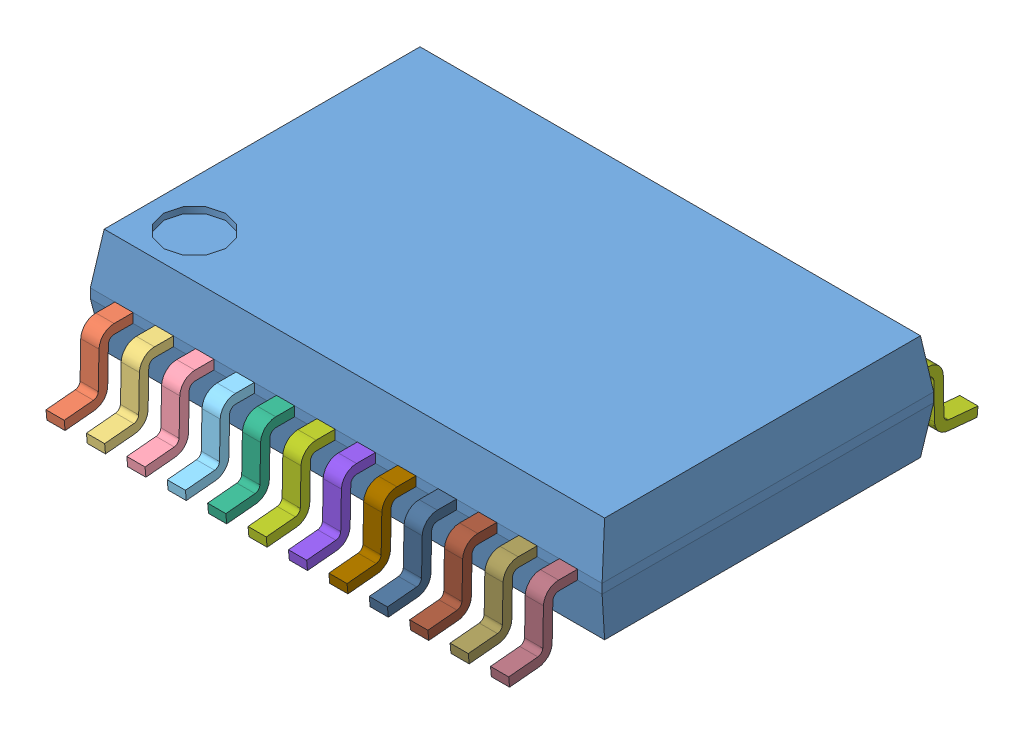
SolidWorks assembly User Library-SOT340-1.sldasm, configuration Default (file format 9000). Lengths in mm.
Overall size (8.23 1.9 7.55).
25 component instances, 25 part files, 0 mates.
Components (placement in the parent):
- User Library-SOT340-1_1_1-1: User Library-SOT340-1_1_1.sldprt [Default] at origin size (8.23 1.7 5.33)
- User Library-SOT340-1_2_1-1: User Library-SOT340-1_2_1.sldprt [Default] at origin size (0.3 1.11 1.11)
- User Library-SOT340-1_3_1-1: User Library-SOT340-1_3_1.sldprt [Default] at origin size (0.3 1.11 1.11)
- User Library-SOT340-1_4_1-1: User Library-SOT340-1_4_1.sldprt [Default] at origin size (0.3 1.11 1.11)
- User Library-SOT340-1_5_1-1: User Library-SOT340-1_5_1.sldprt [Default] at origin size (0.3 1.11 1.11)
- User Library-SOT340-1_6_1-1: User Library-SOT340-1_6_1.sldprt [Default] at origin size (0.3 1.11 1.11)
- User Library-SOT340-1_7_1-1: User Library-SOT340-1_7_1.sldprt [Default] at origin size (0.3 1.11 1.11)
- User Library-SOT340-1_8_1-1: User Library-SOT340-1_8_1.sldprt [Default] at origin size (0.3 1.11 1.11)
- User Library-SOT340-1_9_1-1: User Library-SOT340-1_9_1.sldprt [Default] at origin size (0.3 1.11 1.11)
- User Library-SOT340-1_10_1-1: User Library-SOT340-1_10_1.sldprt [Default] at origin size (0.3 1.11 1.11)
- User Library-SOT340-1_11_1-1: User Library-SOT340-1_11_1.sldprt [Default] at origin size (0.3 1.11 1.11)
- User Library-SOT340-1_12_1-1: User Library-SOT340-1_12_1.sldprt [Default] at origin size (0.3 1.11 1.11)
- User Library-SOT340-1_13_1-1: User Library-SOT340-1_13_1.sldprt [Default] at origin size (0.3 1.11 1.11)
- User Library-SOT340-1_14_1-1: User Library-SOT340-1_14_1.sldprt [Default] at origin size (0.3 1.11 1.11)
- User Library-SOT340-1_15_1-1: User Library-SOT340-1_15_1.sldprt [Default] at origin size (0.3 1.11 1.11)
- User Library-SOT340-1_16_1-1: User Library-SOT340-1_16_1.sldprt [Default] at origin size (0.3 1.11 1.11)
- User Library-SOT340-1_17_1-1: User Library-SOT340-1_17_1.sldprt [Default] at origin size (0.3 1.11 1.11)
- User Library-SOT340-1_18_1-1: User Library-SOT340-1_18_1.sldprt [Default] at origin size (0.3 1.11 1.11)
- User Library-SOT340-1_19_1-1: User Library-SOT340-1_19_1.sldprt [Default] at origin size (0.3 1.11 1.11)
- User Library-SOT340-1_20_1-1: User Library-SOT340-1_20_1.sldprt [Default] at origin size (0.3 1.11 1.11)
- User Library-SOT340-1_21_1-1: User Library-SOT340-1_21_1.sldprt [Default] at origin size (0.3 1.11 1.11)
- User Library-SOT340-1_22_1-1: User Library-SOT340-1_22_1.sldprt [Default] at origin size (0.3 1.11 1.11)
- User Library-SOT340-1_23_1-1: User Library-SOT340-1_23_1.sldprt [Default] at origin size (0.3 1.11 1.11)
- User Library-SOT340-1_24_1-1: User Library-SOT340-1_24_1.sldprt [Default] at origin size (0.3 1.11 1.11)
- User Library-SOT340-1_25_1-1: User Library-SOT340-1_25_1.sldprt [Default] at origin size (0.3 1.11 1.11)
